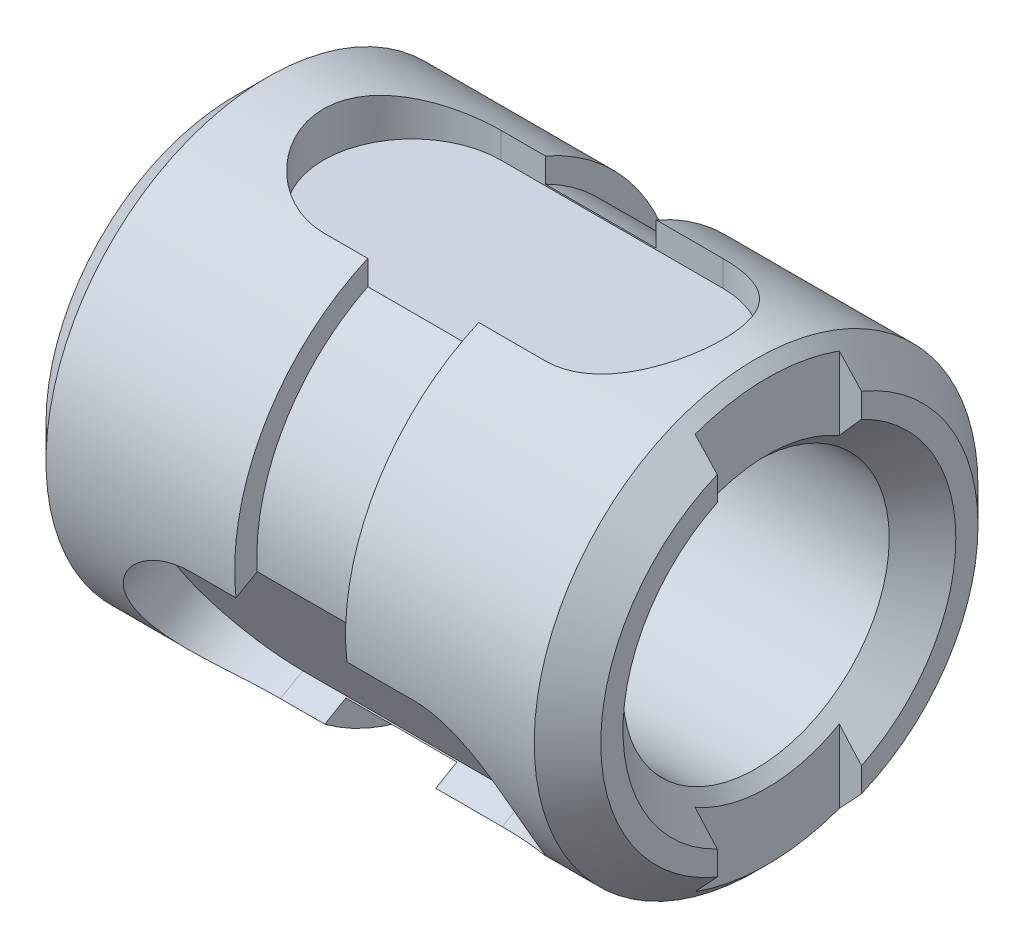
from build123d import *

# Parameters (mm, degrees)
CUT_EXTRUDE1_START = 8
CUT_EXTRUDE1_DEPTH = 21.722813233
CIRPATTERN1_COUNT  = 3
SKETCH3_W          = 5
SKETCH3_H          = 8
SKETCH4_W          = 6.5
SKETCH4_H          = 25
CUT_EXTRUDE3_DEPTH = 1


with BuildPart() as part:
    # Sketch1 → Revolve1 (revolve)
    with BuildSketch(Plane.XY, mode=Mode.PRIVATE) as revolve1_sk:
        Polygon((-23.5, 10), (-1.5, 10), (0, 8.5), (0, 7.5), (-1.5, 6), (-23.5, 6), (-25, 7.5), (-25, 8.5), align=None)
    revolve(revolve1_sk.sketch.rotate(Axis((0, 0, 0), (-1, 0, 0)), 90), axis=Axis((0, 0, 0), (-1, 0, 0)))

    # Sketch2 → Cut-Extrude1 (cut, through all)
    with BuildSketch(Plane(origin=(0, 0, 0), x_dir=(1, 0, 0), z_dir=(0, 1, 0)).offset(CUT_EXTRUDE1_START)):
        with BuildLine():
            Line((-17, 4), (-7, 4))
            ThreePointArc((-7, 4), (-3, 0), (-7, -4))
            Line((-7, -4), (-17, -4))
            ThreePointArc((-17, -4), (-21, 0), (-17, 4))
        make_face()
    cut_extrude1 = extrude(amount=CUT_EXTRUDE1_DEPTH, mode=Mode.SUBTRACT)

    # CirPattern1: Cut-Extrude1 ×3 about axis
    cirpattern1_axis = Axis((0, 0, 0), (1, 0, 0))
    for i in range(1, CIRPATTERN1_COUNT):
        add(cut_extrude1.rotate(cirpattern1_axis, i * 360 / CIRPATTERN1_COUNT), mode=Mode.SUBTRACT)

    # Sketch3 → Cut-Revolve1 (revolve, cut)
    with BuildSketch(Plane.XY, mode=Mode.PRIVATE) as cut_revolve1_sk:
        with Locations((-12.5, 13)):
            Rectangle(SKETCH3_W, SKETCH3_H)
    revolve(cut_revolve1_sk.sketch.rotate(Axis((0, 0, 0), (-1, 0, 0)), 90), axis=Axis((0, 0, 0), (-1, 0, 0)), mode=Mode.SUBTRACT)

    # Sketch4 → Cut-Extrude3 (cut)
    with BuildSketch(Plane(origin=(0, 0, 0), x_dir=(0, 0, -1), z_dir=(1, 0, 0))):
        Rectangle(SKETCH4_W, SKETCH4_H)
    extrude(amount=-CUT_EXTRUDE3_DEPTH, mode=Mode.SUBTRACT)


solid = part.part
